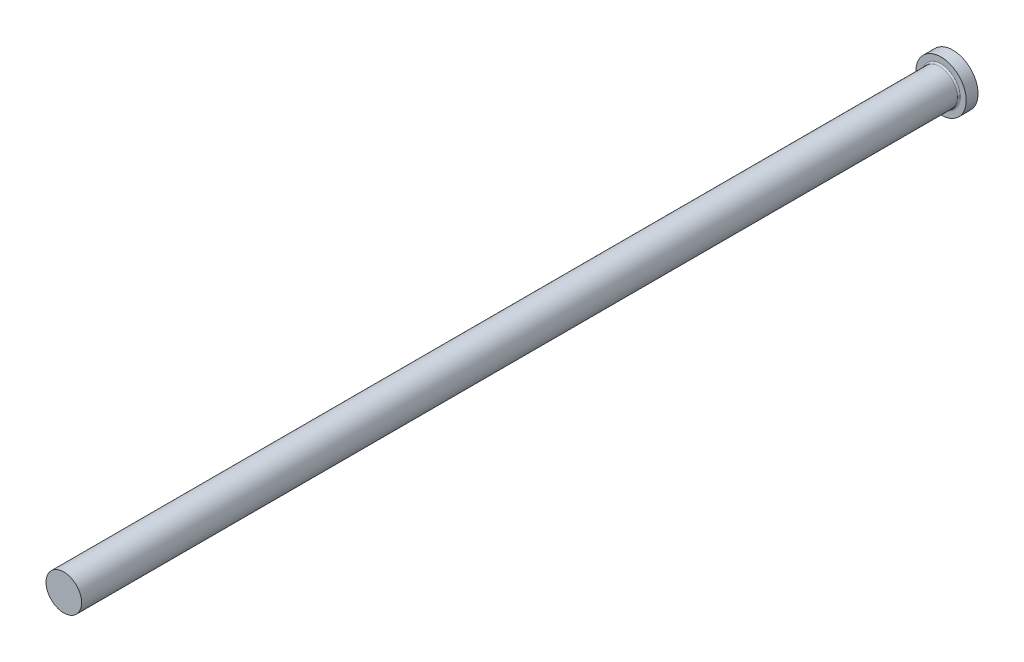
from build123d import *

# Parameters (mm, degrees)
FILLET1_R = 0.5


with BuildPart() as part:
    # FV → Revolve1 (revolve)
    with BuildSketch(Plane(origin=(0, 0, 0), x_dir=(1, 0, 0), z_dir=(0, 1, 0)), mode=Mode.PRIVATE) as revolve1_sk:
        Polygon((0, 0), (8.5, 0), (8.5, -4), (6, -4), (6, -300), (0, -300), align=None)
    revolve(revolve1_sk.sketch.rotate(Axis((0, 0, -9.033228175), (0, 0, 1)), 180), axis=Axis((0, 0, -9.033228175), (0, 0, 1)))

    # Fillet1
    fillet1_edges = [part.edges().sort_by_distance(p)[0] for p in [
        (6, 0, 4),
    ]]
    fillet(fillet1_edges, radius=FILLET1_R)


solid = part.part
